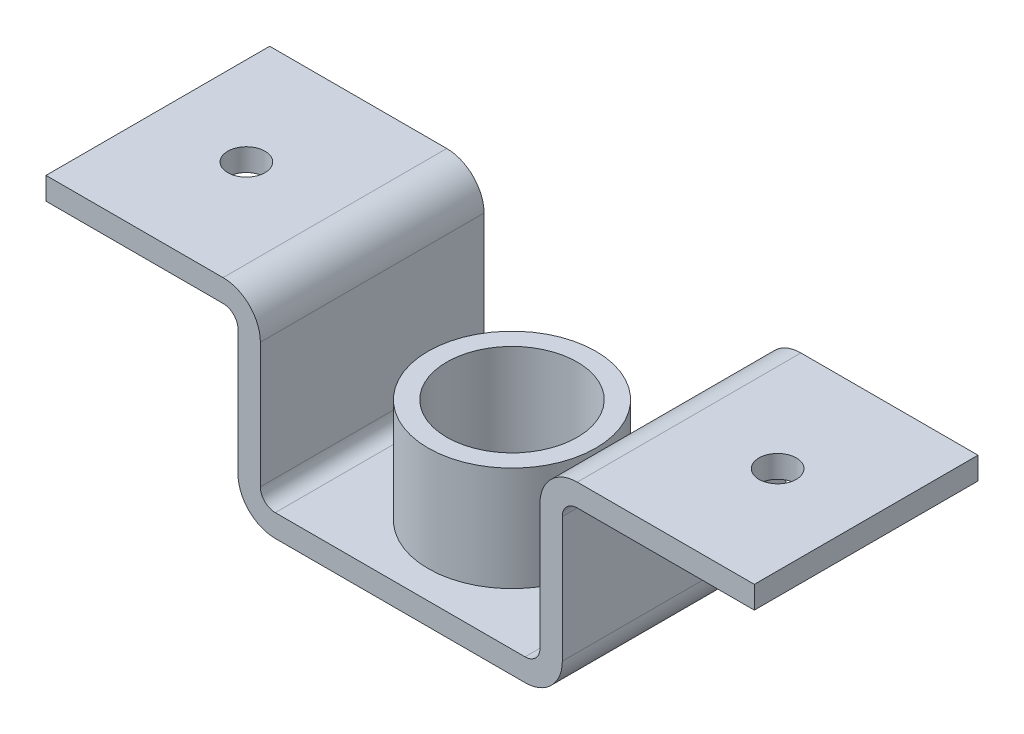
from build123d import *

# Parameters (mm, degrees)
BOSS_EXTRUDE1_DEPTH = 150
FILLET1_R           = 20
FILLET2_R           = 50
SKETCH2_R           = 37.5
CUT_EXTRUDE2_DEPTH  = 30
SKETCH3_R           = 112.5
SKETCH3_R_2         = 87.5
BOSS_EXTRUDE2_DEPTH = 140
SKETCH4_R           = 25
CUT_EXTRUDE3_DEPTH  = 30


with BuildPart() as part:
    # Sketch1 → Boss-Extrude1 (new, symmetric)
    with BuildSketch(Plane.XY):
        Polygon((-217.5, 0), (217.5, 0), (217.5, 238), (475, 238), (475, 268), (187.5, 268), (187.5, 30), (-187.5, 30), (-187.5, 268), (-475, 268), (-475, 238), (-217.5, 238), align=None)
    extrude(amount=BOSS_EXTRUDE1_DEPTH, both=True)

    # Fillet1
    fillet1_edges = [part.edges().sort_by_distance(p)[0] for p in [
        (217.5, 238, 0),
        (-217.5, 238, 0),
        (-187.5, 30, 0),
        (187.5, 30, 0),
    ]]
    fillet(fillet1_edges, radius=FILLET1_R)

    # Fillet2
    fillet2_edges = [part.edges().sort_by_distance(p)[0] for p in [
        (187.5, 268, 0),
        (217.5, 0, 0),
        (-217.5, 0, 0),
        (-187.5, 268, 0),
    ]]
    fillet(fillet2_edges, radius=FILLET2_R)

    # Sketch2 → Cut-Extrude2 (cut)
    with BuildSketch(Plane(origin=(0, 30, 0), x_dir=(1, 0, 0), z_dir=(0, 1, 0))):
        with Locations(Location((0, 0, 0), (0, 0, 270))):
            Circle(SKETCH2_R)
    extrude(amount=-CUT_EXTRUDE2_DEPTH, mode=Mode.SUBTRACT)

    # Sketch3 → Boss-Extrude2 (add)
    with BuildSketch(Plane(origin=(0, 30, 0), x_dir=(1, 0, 0), z_dir=(0, 1, 0))):
        with Locations(Location((0, 0, 0), (0, 0, 90))):
            Circle(SKETCH3_R)
        with Locations(Location((0, 0, 0), (0, 0, 270))):
            Circle(SKETCH3_R_2, mode=Mode.SUBTRACT)
    extrude(amount=BOSS_EXTRUDE2_DEPTH)

    # Sketch4 → Cut-Extrude3 (cut)
    with BuildSketch(Plane(origin=(0, 268, 0), x_dir=(1, 0, 0), z_dir=(0, 1, 0))):
        with Locations(Location((-356.25, 0, 0), (0, 0, 270))):
            Circle(SKETCH4_R)
    cut_extrude3 = extrude(amount=-CUT_EXTRUDE3_DEPTH, mode=Mode.SUBTRACT)

    # Mirror1: Cut-Extrude3 across plane
    add(cut_extrude3.mirror(Plane(origin=(0, 0, 0), x_dir=(0, 0, 1), z_dir=(1, 0, 0))), mode=Mode.SUBTRACT)


solid = part.part
